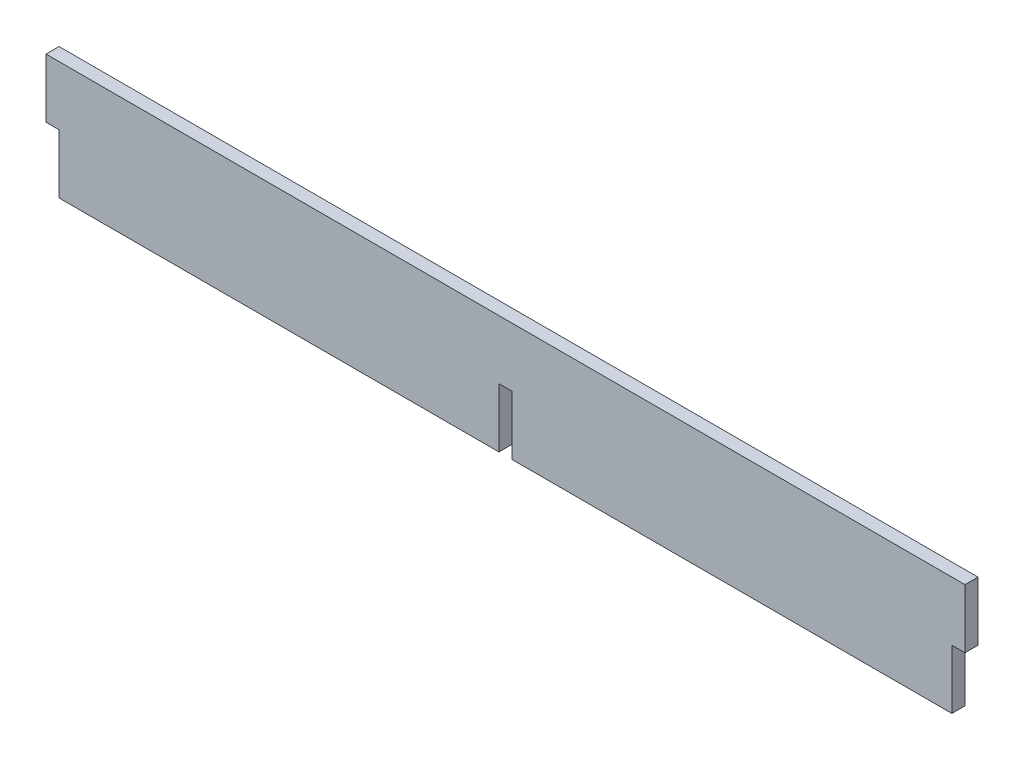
from build123d import *

# Parameters (mm, degrees)
BOSS_EXTRUDE1_DEPTH = 3.2


with BuildPart() as part:
    # Sketch1 → Boss-Extrude1 (new body)
    with BuildSketch(Plane.XY):
        Polygon((114.315, 0), (222.225, 0), (222.225, 14.49), (225.425, 14.49), (225.425, 28.97), (0, 28.97), (0, 14.49), (3.2, 14.49), (3.2, 0), (111.115, 0), (111.115, 14.49), (114.315, 14.49), align=None)
    extrude(amount=BOSS_EXTRUDE1_DEPTH)


solid = part.part
